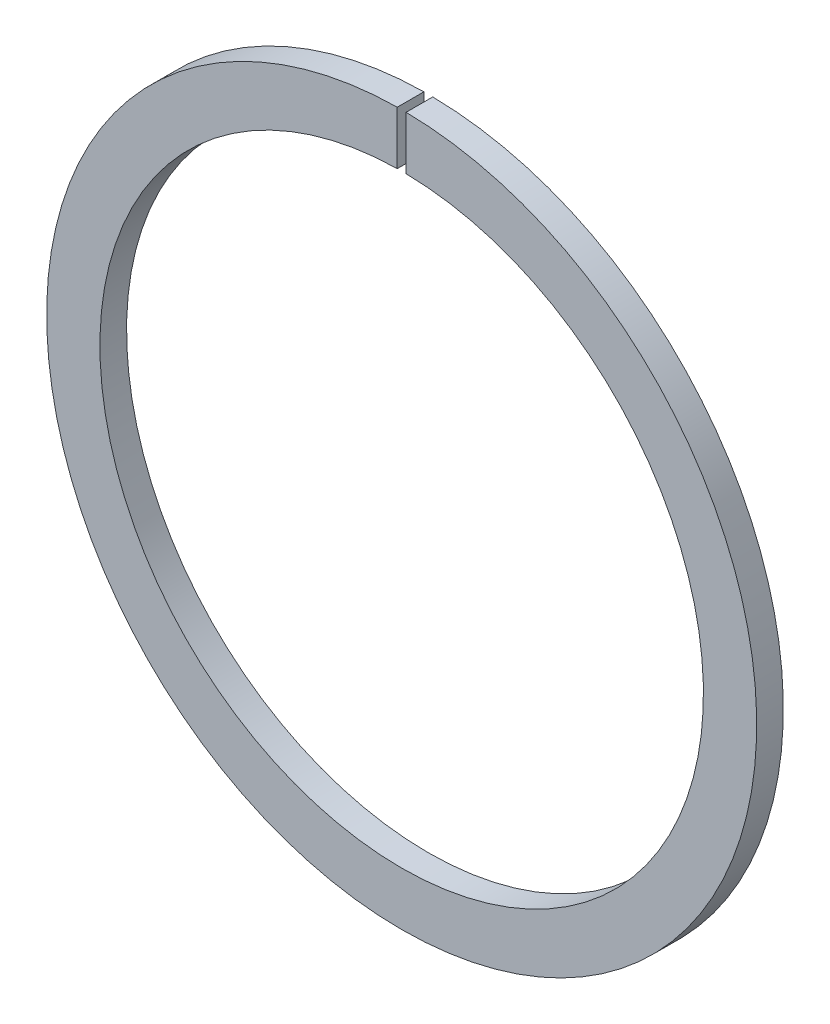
ISO-10303-21;
HEADER;
FILE_DESCRIPTION(('STEP AP214'),'2;1');
FILE_NAME('part.step','',(''),(''),'','','');
FILE_SCHEMA(('AUTOMOTIVE_DESIGN { 1 0 10303 214 1 1 1 1 }'));
ENDSEC;
DATA;
#1=APPLICATION_CONTEXT('core data for automotive mechanical design processes');
#2=APPLICATION_PROTOCOL_DEFINITION('international standard','automotive_design',2000,#1);
#3=PRODUCT_CONTEXT('',#1,'mechanical');
#4=PRODUCT('Part','Part','',(#3));
#5=PRODUCT_RELATED_PRODUCT_CATEGORY('part','',(#4));
#6=PRODUCT_DEFINITION_FORMATION('','',#4);
#7=PRODUCT_DEFINITION_CONTEXT('part definition',#1,'design');
#8=PRODUCT_DEFINITION('design','',#6,#7);
#9=PRODUCT_DEFINITION_SHAPE('','',#8);
#10=(LENGTH_UNIT() NAMED_UNIT(*) SI_UNIT(.MILLI.,.METRE.));
#11=(NAMED_UNIT(*) PLANE_ANGLE_UNIT() SI_UNIT($,.RADIAN.));
#12=(NAMED_UNIT(*) SI_UNIT($,.STERADIAN.) SOLID_ANGLE_UNIT());
#13=UNCERTAINTY_MEASURE_WITH_UNIT(LENGTH_MEASURE(1.E-05),#10,'distance_accuracy_value','');
#14=(GEOMETRIC_REPRESENTATION_CONTEXT(3) GLOBAL_UNCERTAINTY_ASSIGNED_CONTEXT((#13)) GLOBAL_UNIT_ASSIGNED_CONTEXT((#10,
#11,#12)) REPRESENTATION_CONTEXT('',''));
#15=CARTESIAN_POINT('',(0.,0.,0.));
#16=DIRECTION('',(0.,0.,1.));
#17=DIRECTION('',(1.,0.,0.));
#18=AXIS2_PLACEMENT_3D('',#15,#16,#17);
#19=CARTESIAN_POINT('',(0.,0.,1.5));
#20=DIRECTION('',(0.,0.,-1.));
#21=DIRECTION('',(-1.,0.,0.));
#22=AXIS2_PLACEMENT_3D('',#19,#20,#21);
#23=CYLINDRICAL_SURFACE('',#22,17.);
#24=CARTESIAN_POINT('',(0.,0.,0.));
#25=DIRECTION('',(0.,0.,-1.));
#26=DIRECTION('',(1.,0.,0.));
#27=AXIS2_PLACEMENT_3D('',#24,#25,#26);
#28=CIRCLE('',#27,17.);
#29=CARTESIAN_POINT('',(0.25,16.9981616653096,0.));
#30=VERTEX_POINT('',#29);
#31=CARTESIAN_POINT('',(-0.25,16.9981616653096,0.));
#32=VERTEX_POINT('',#31);
#33=EDGE_CURVE('E74',#30,#32,#28,.T.);
#34=ORIENTED_EDGE('',*,*,#33,.T.);
#35=DIRECTION('',(0.,0.,-1.));
#36=VECTOR('',#35,1.);
#37=CARTESIAN_POINT('',(-0.25,16.9981616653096,1.5));
#38=LINE('',#37,#36);
#39=CARTESIAN_POINT('',(-0.25,16.9981616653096,1.5));
#40=VERTEX_POINT('',#39);
#41=EDGE_CURVE('E11',#40,#32,#38,.T.);
#42=ORIENTED_EDGE('',*,*,#41,.F.);
#43=CARTESIAN_POINT('',(0.,0.,1.5));
#44=DIRECTION('',(0.,0.,-1.));
#45=DIRECTION('',(1.,0.,0.));
#46=AXIS2_PLACEMENT_3D('',#43,#44,#45);
#47=CIRCLE('',#46,17.);
#48=CARTESIAN_POINT('',(0.25,16.9981616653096,1.49999999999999));
#49=VERTEX_POINT('',#48);
#50=EDGE_CURVE('E92',#49,#40,#47,.T.);
#51=ORIENTED_EDGE('',*,*,#50,.F.);
#52=DIRECTION('',(0.,0.,-1.));
#53=VECTOR('',#52,1.);
#54=CARTESIAN_POINT('',(0.25,16.9981616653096,1.49999999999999));
#55=LINE('',#54,#53);
#56=EDGE_CURVE('E86',#49,#30,#55,.T.);
#57=ORIENTED_EDGE('',*,*,#56,.T.);
#58=EDGE_LOOP('',(#34,#42,#51,#57));
#59=FACE_BOUND('',#58,.T.);
#60=ADVANCED_FACE('F30',(#59),#23,.F.);
#61=CARTESIAN_POINT('',(-0.25,16.9981616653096,1.5));
#62=DIRECTION('',(-1.,0.,0.));
#63=DIRECTION('',(0.,0.,1.));
#64=AXIS2_PLACEMENT_3D('',#61,#62,#63);
#65=PLANE('',#64);
#66=DIRECTION('',(0.,1.,0.));
#67=VECTOR('',#66,1.);
#68=CARTESIAN_POINT('',(-0.25,16.9981616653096,0.));
#69=LINE('',#68,#67);
#70=CARTESIAN_POINT('',(-0.25,19.9984374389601,0.));
#71=VERTEX_POINT('',#70);
#72=EDGE_CURVE('E70',#32,#71,#69,.T.);
#73=ORIENTED_EDGE('',*,*,#72,.T.);
#74=DIRECTION('',(0.,0.,-1.));
#75=VECTOR('',#74,1.);
#76=CARTESIAN_POINT('',(-0.25,19.9984374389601,1.5));
#77=LINE('',#76,#75);
#78=CARTESIAN_POINT('',(-0.25,19.9984374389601,1.5));
#79=VERTEX_POINT('',#78);
#80=EDGE_CURVE('E37',#79,#71,#77,.T.);
#81=ORIENTED_EDGE('',*,*,#80,.F.);
#82=DIRECTION('',(0.,1.,0.));
#83=VECTOR('',#82,1.);
#84=CARTESIAN_POINT('',(-0.25,16.9981616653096,1.5));
#85=LINE('',#84,#83);
#86=EDGE_CURVE('E82',#40,#79,#85,.T.);
#87=ORIENTED_EDGE('',*,*,#86,.F.);
#88=ORIENTED_EDGE('',*,*,#41,.T.);
#89=EDGE_LOOP('',(#73,#81,#87,#88));
#90=FACE_BOUND('',#89,.T.);
#91=ADVANCED_FACE('F81',(#90),#65,.F.);
#92=CARTESIAN_POINT('',(0.,0.,1.5));
#93=DIRECTION('',(0.,0.,-1.));
#94=DIRECTION('',(-1.,0.,0.));
#95=AXIS2_PLACEMENT_3D('',#92,#93,#94);
#96=CYLINDRICAL_SURFACE('',#95,20.);
#97=CARTESIAN_POINT('',(0.,0.,0.));
#98=DIRECTION('',(0.,0.,1.));
#99=DIRECTION('',(1.,0.,0.));
#100=AXIS2_PLACEMENT_3D('',#97,#98,#99);
#101=CIRCLE('',#100,20.);
#102=CARTESIAN_POINT('',(0.25,19.9984374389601,0.));
#103=VERTEX_POINT('',#102);
#104=EDGE_CURVE('E75',#71,#103,#101,.T.);
#105=ORIENTED_EDGE('',*,*,#104,.T.);
#106=DIRECTION('',(0.,0.,-1.));
#107=VECTOR('',#106,1.);
#108=CARTESIAN_POINT('',(0.25,19.9984374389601,1.49999999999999));
#109=LINE('',#108,#107);
#110=CARTESIAN_POINT('',(0.25,19.9984374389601,1.49999999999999));
#111=VERTEX_POINT('',#110);
#112=EDGE_CURVE('E98',#111,#103,#109,.T.);
#113=ORIENTED_EDGE('',*,*,#112,.F.);
#114=CARTESIAN_POINT('',(0.,0.,1.5));
#115=DIRECTION('',(0.,0.,1.));
#116=DIRECTION('',(1.,0.,0.));
#117=AXIS2_PLACEMENT_3D('',#114,#115,#116);
#118=CIRCLE('',#117,20.);
#119=EDGE_CURVE('E49',#79,#111,#118,.T.);
#120=ORIENTED_EDGE('',*,*,#119,.F.);
#121=ORIENTED_EDGE('',*,*,#80,.T.);
#122=EDGE_LOOP('',(#105,#113,#120,#121));
#123=FACE_BOUND('',#122,.T.);
#124=ADVANCED_FACE('F101',(#123),#96,.T.);
#125=CARTESIAN_POINT('',(0.25,16.9981616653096,1.49999999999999));
#126=DIRECTION('',(1.,0.,0.));
#127=DIRECTION('',(0.,0.,-1.));
#128=AXIS2_PLACEMENT_3D('',#125,#126,#127);
#129=PLANE('',#128);
#130=DIRECTION('',(0.,-1.,0.));
#131=VECTOR('',#130,1.);
#132=CARTESIAN_POINT('',(0.25,16.9981616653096,0.));
#133=LINE('',#132,#131);
#134=EDGE_CURVE('E90',#103,#30,#133,.T.);
#135=ORIENTED_EDGE('',*,*,#134,.T.);
#136=ORIENTED_EDGE('',*,*,#56,.F.);
#137=DIRECTION('',(0.,-1.,0.));
#138=VECTOR('',#137,1.);
#139=CARTESIAN_POINT('',(0.25,16.9981616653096,1.49999999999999));
#140=LINE('',#139,#138);
#141=EDGE_CURVE('E44',#111,#49,#140,.T.);
#142=ORIENTED_EDGE('',*,*,#141,.F.);
#143=ORIENTED_EDGE('',*,*,#112,.T.);
#144=EDGE_LOOP('',(#135,#136,#142,#143));
#145=FACE_BOUND('',#144,.T.);
#146=ADVANCED_FACE('F103',(#145),#129,.F.);
#147=CARTESIAN_POINT('',(0.,0.,1.5));
#148=DIRECTION('',(0.,0.,1.));
#149=DIRECTION('',(1.,0.,0.));
#150=AXIS2_PLACEMENT_3D('',#147,#148,#149);
#151=PLANE('',#150);
#152=ORIENTED_EDGE('',*,*,#50,.T.);
#153=ORIENTED_EDGE('',*,*,#86,.T.);
#154=ORIENTED_EDGE('',*,*,#119,.T.);
#155=ORIENTED_EDGE('',*,*,#141,.T.);
#156=EDGE_LOOP('',(#152,#153,#154,#155));
#157=FACE_BOUND('',#156,.T.);
#158=ADVANCED_FACE('F104',(#157),#151,.T.);
#159=CARTESIAN_POINT('',(0.,0.,0.));
#160=DIRECTION('',(0.,0.,1.));
#161=DIRECTION('',(1.,0.,0.));
#162=AXIS2_PLACEMENT_3D('',#159,#160,#161);
#163=PLANE('',#162);
#164=ORIENTED_EDGE('',*,*,#33,.F.);
#165=ORIENTED_EDGE('',*,*,#134,.F.);
#166=ORIENTED_EDGE('',*,*,#104,.F.);
#167=ORIENTED_EDGE('',*,*,#72,.F.);
#168=EDGE_LOOP('',(#164,#165,#166,#167));
#169=FACE_BOUND('',#168,.T.);
#170=ADVANCED_FACE('F71',(#169),#163,.F.);
#171=CLOSED_SHELL('',(#60,#91,#124,#146,#158,#170));
#172=MANIFOLD_SOLID_BREP('B2',#171);
#173=ADVANCED_BREP_SHAPE_REPRESENTATION('',(#18,#172),#14);
#174=SHAPE_DEFINITION_REPRESENTATION(#9,#173);
ENDSEC;
END-ISO-10303-21;
